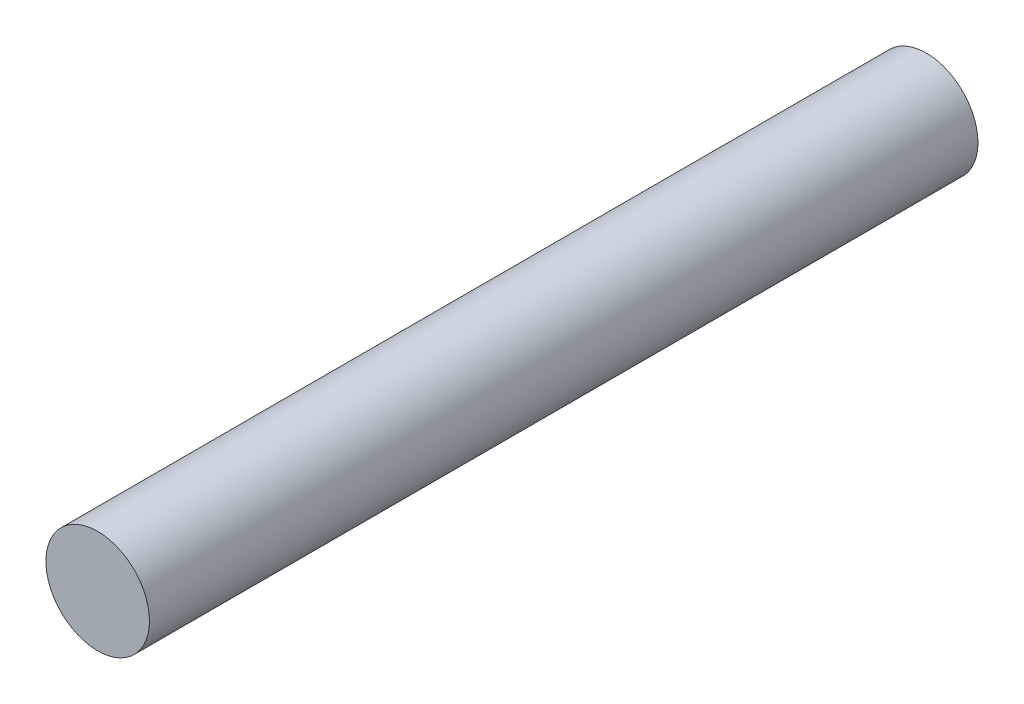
from build123d import *

# Parameters (mm, degrees)
SKETCH1_R           = 1.5875
BOSS_EXTRUDE1_DEPTH = 12.7


with BuildPart() as part:
    # Sketch1 → Boss-Extrude1 (new, symmetric)
    with BuildSketch(Plane.XY):
        Circle(SKETCH1_R)
    extrude(amount=BOSS_EXTRUDE1_DEPTH, both=True)


solid = part.part
